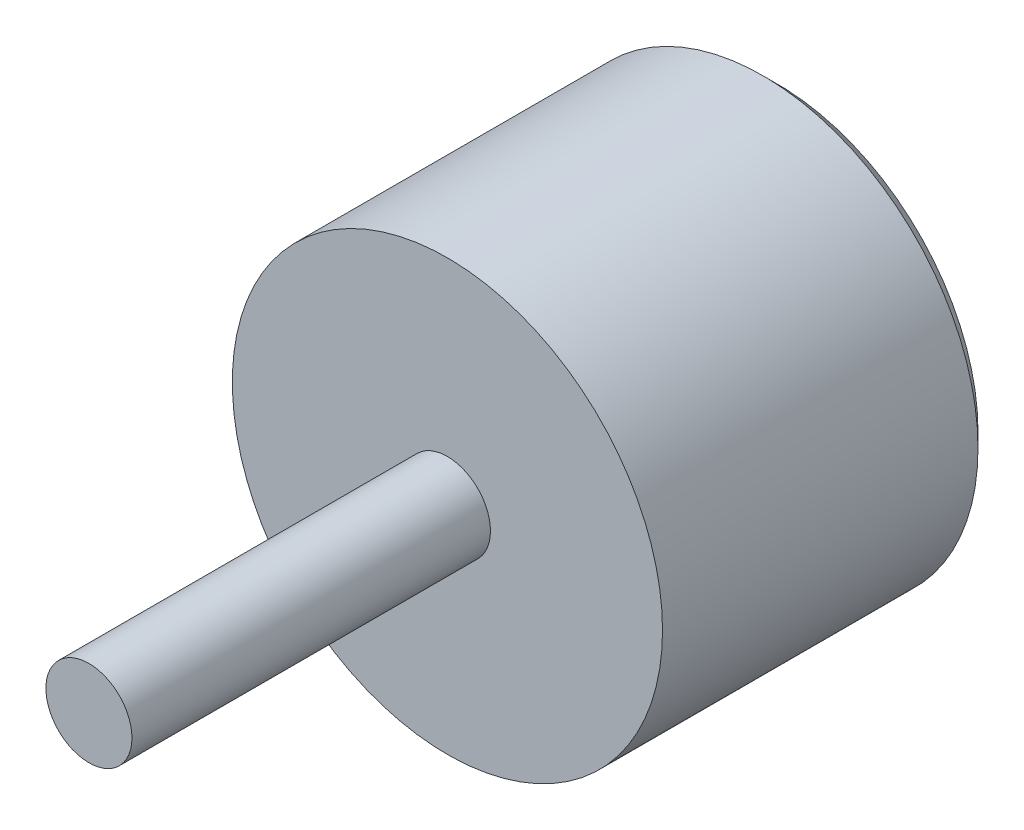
ISO-10303-21;
HEADER;
FILE_DESCRIPTION(('STEP AP214'),'2;1');
FILE_NAME('part.step','',(''),(''),'','','');
FILE_SCHEMA(('AUTOMOTIVE_DESIGN { 1 0 10303 214 1 1 1 1 }'));
ENDSEC;
DATA;
#1=APPLICATION_CONTEXT('core data for automotive mechanical design processes');
#2=APPLICATION_PROTOCOL_DEFINITION('international standard','automotive_design',2000,#1);
#3=PRODUCT_CONTEXT('',#1,'mechanical');
#4=PRODUCT('Part','Part','',(#3));
#5=PRODUCT_RELATED_PRODUCT_CATEGORY('part','',(#4));
#6=PRODUCT_DEFINITION_FORMATION('','',#4);
#7=PRODUCT_DEFINITION_CONTEXT('part definition',#1,'design');
#8=PRODUCT_DEFINITION('design','',#6,#7);
#9=PRODUCT_DEFINITION_SHAPE('','',#8);
#10=(LENGTH_UNIT() NAMED_UNIT(*) SI_UNIT(.MILLI.,.METRE.));
#11=(NAMED_UNIT(*) PLANE_ANGLE_UNIT() SI_UNIT($,.RADIAN.));
#12=(NAMED_UNIT(*) SI_UNIT($,.STERADIAN.) SOLID_ANGLE_UNIT());
#13=UNCERTAINTY_MEASURE_WITH_UNIT(LENGTH_MEASURE(1.E-05),#10,'distance_accuracy_value','');
#14=(GEOMETRIC_REPRESENTATION_CONTEXT(3) GLOBAL_UNCERTAINTY_ASSIGNED_CONTEXT((#13)) GLOBAL_UNIT_ASSIGNED_CONTEXT((#10,
#11,#12)) REPRESENTATION_CONTEXT('',''));
#15=CARTESIAN_POINT('',(0.,0.,0.));
#16=DIRECTION('',(0.,0.,1.));
#17=DIRECTION('',(1.,0.,0.));
#18=AXIS2_PLACEMENT_3D('',#15,#16,#17);
#19=CARTESIAN_POINT('',(0.,0.,46.));
#20=DIRECTION('',(0.,0.,1.));
#21=DIRECTION('',(1.,0.,0.));
#22=AXIS2_PLACEMENT_3D('',#19,#20,#21);
#23=PLANE('',#22);
#24=CARTESIAN_POINT('',(0.,0.,46.));
#25=DIRECTION('',(0.,0.,1.));
#26=DIRECTION('',(1.,0.,0.));
#27=AXIS2_PLACEMENT_3D('',#24,#25,#26);
#28=CIRCLE('',#27,30.);
#29=CARTESIAN_POINT('',(30.,0.,46.));
#30=VERTEX_POINT('',#29);
#31=EDGE_CURVE('E45',#30,#30,#28,.T.);
#32=ORIENTED_EDGE('',*,*,#31,.T.);
#33=EDGE_LOOP('',(#32));
#34=FACE_BOUND('',#33,.T.);
#35=CARTESIAN_POINT('',(0.,0.,46.));
#36=DIRECTION('',(0.,0.,1.));
#37=DIRECTION('',(1.,0.,0.));
#38=AXIS2_PLACEMENT_3D('',#35,#36,#37);
#39=CIRCLE('',#38,6.);
#40=CARTESIAN_POINT('',(6.,0.,46.));
#41=VERTEX_POINT('',#40);
#42=EDGE_CURVE('E52',#41,#41,#39,.T.);
#43=ORIENTED_EDGE('',*,*,#42,.F.);
#44=EDGE_LOOP('',(#43));
#45=FACE_BOUND('',#44,.T.);
#46=ADVANCED_FACE('F31',(#34,#45),#23,.T.);
#47=CARTESIAN_POINT('',(0.,0.,46.));
#48=DIRECTION('',(0.,0.,-1.));
#49=DIRECTION('',(-1.,0.,0.));
#50=AXIS2_PLACEMENT_3D('',#47,#48,#49);
#51=CYLINDRICAL_SURFACE('',#50,30.);
#52=CARTESIAN_POINT('',(0.,0.,2.00000000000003));
#53=DIRECTION('',(0.,0.,1.));
#54=DIRECTION('',(1.,0.,0.));
#55=AXIS2_PLACEMENT_3D('',#52,#53,#54);
#56=CIRCLE('',#55,30.);
#57=CARTESIAN_POINT('',(30.,0.,2.00000000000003));
#58=VERTEX_POINT('',#57);
#59=EDGE_CURVE('E39',#58,#58,#56,.T.);
#60=ORIENTED_EDGE('',*,*,#59,.T.);
#61=EDGE_LOOP('',(#60));
#62=FACE_BOUND('',#61,.T.);
#63=ORIENTED_EDGE('',*,*,#31,.F.);
#64=EDGE_LOOP('',(#63));
#65=FACE_BOUND('',#64,.T.);
#66=ADVANCED_FACE('F76',(#62,#65),#51,.T.);
#67=CARTESIAN_POINT('',(0.,0.,0.));
#68=DIRECTION('',(0.,0.,1.));
#69=DIRECTION('',(1.,0.,0.));
#70=AXIS2_PLACEMENT_3D('',#67,#68,#69);
#71=PLANE('',#70);
#72=CARTESIAN_POINT('',(0.,0.,0.));
#73=DIRECTION('',(0.,0.,1.));
#74=DIRECTION('',(1.,0.,0.));
#75=AXIS2_PLACEMENT_3D('',#72,#73,#74);
#76=CIRCLE('',#75,28.);
#77=CARTESIAN_POINT('',(28.,0.,0.));
#78=VERTEX_POINT('',#77);
#79=EDGE_CURVE('E10',#78,#78,#76,.F.);
#80=ORIENTED_EDGE('',*,*,#79,.T.);
#81=EDGE_LOOP('',(#80));
#82=FACE_BOUND('',#81,.T.);
#83=CARTESIAN_POINT('',(0.,0.,0.));
#84=DIRECTION('',(0.,0.,-1.));
#85=DIRECTION('',(-1.,0.,0.));
#86=AXIS2_PLACEMENT_3D('',#83,#84,#85);
#87=CIRCLE('',#86,17.5);
#88=CARTESIAN_POINT('',(-17.5,0.,0.));
#89=VERTEX_POINT('',#88);
#90=EDGE_CURVE('E58',#89,#89,#87,.T.);
#91=ORIENTED_EDGE('',*,*,#90,.F.);
#92=EDGE_LOOP('',(#91));
#93=FACE_BOUND('',#92,.T.);
#94=ADVANCED_FACE('F73',(#82,#93),#71,.F.);
#95=CARTESIAN_POINT('',(0.,0.,96.));
#96=DIRECTION('',(0.,0.,-1.));
#97=DIRECTION('',(-1.,0.,0.));
#98=AXIS2_PLACEMENT_3D('',#95,#96,#97);
#99=CYLINDRICAL_SURFACE('',#98,6.);
#100=CARTESIAN_POINT('',(0.,0.,96.));
#101=DIRECTION('',(0.,0.,1.));
#102=DIRECTION('',(1.,0.,0.));
#103=AXIS2_PLACEMENT_3D('',#100,#101,#102);
#104=CIRCLE('',#103,6.);
#105=CARTESIAN_POINT('',(6.,0.,96.));
#106=VERTEX_POINT('',#105);
#107=EDGE_CURVE('E49',#106,#106,#104,.T.);
#108=ORIENTED_EDGE('',*,*,#107,.F.);
#109=EDGE_LOOP('',(#108));
#110=FACE_BOUND('',#109,.T.);
#111=ORIENTED_EDGE('',*,*,#42,.T.);
#112=EDGE_LOOP('',(#111));
#113=FACE_BOUND('',#112,.T.);
#114=ADVANCED_FACE('F75',(#110,#113),#99,.T.);
#115=CARTESIAN_POINT('',(0.,0.,96.));
#116=DIRECTION('',(0.,0.,1.));
#117=DIRECTION('',(1.,0.,0.));
#118=AXIS2_PLACEMENT_3D('',#115,#116,#117);
#119=PLANE('',#118);
#120=ORIENTED_EDGE('',*,*,#107,.T.);
#121=EDGE_LOOP('',(#120));
#122=FACE_BOUND('',#121,.T.);
#123=ADVANCED_FACE('F69',(#122),#119,.T.);
#124=CARTESIAN_POINT('',(0.,0.,30.));
#125=DIRECTION('',(0.,0.,-1.));
#126=DIRECTION('',(-1.,0.,0.));
#127=AXIS2_PLACEMENT_3D('',#124,#125,#126);
#128=CYLINDRICAL_SURFACE('',#127,17.5);
#129=CARTESIAN_POINT('',(0.,0.,30.));
#130=DIRECTION('',(0.,0.,-1.));
#131=DIRECTION('',(-1.,0.,0.));
#132=AXIS2_PLACEMENT_3D('',#129,#130,#131);
#133=CIRCLE('',#132,17.5);
#134=CARTESIAN_POINT('',(-17.5,0.,30.));
#135=VERTEX_POINT('',#134);
#136=EDGE_CURVE('E55',#135,#135,#133,.T.);
#137=ORIENTED_EDGE('',*,*,#136,.F.);
#138=EDGE_LOOP('',(#137));
#139=FACE_BOUND('',#138,.T.);
#140=ORIENTED_EDGE('',*,*,#90,.T.);
#141=EDGE_LOOP('',(#140));
#142=FACE_BOUND('',#141,.T.);
#143=ADVANCED_FACE('F66',(#139,#142),#128,.F.);
#144=CARTESIAN_POINT('',(0.,0.,30.));
#145=DIRECTION('',(0.,0.,-1.));
#146=DIRECTION('',(-1.,0.,0.));
#147=AXIS2_PLACEMENT_3D('',#144,#145,#146);
#148=PLANE('',#147);
#149=ORIENTED_EDGE('',*,*,#136,.T.);
#150=EDGE_LOOP('',(#149));
#151=FACE_BOUND('',#150,.T.);
#152=ADVANCED_FACE('F64',(#151),#148,.T.);
#153=CARTESIAN_POINT('',(0.,0.,2.00000000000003));
#154=DIRECTION('',(0.,0.,1.));
#155=DIRECTION('',(1.,0.,0.));
#156=AXIS2_PLACEMENT_3D('',#153,#154,#155);
#157=CONICAL_SURFACE('',#156,30.,0.785398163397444);
#158=ORIENTED_EDGE('',*,*,#79,.F.);
#159=EDGE_LOOP('',(#158));
#160=FACE_BOUND('',#159,.T.);
#161=ORIENTED_EDGE('',*,*,#59,.F.);
#162=EDGE_LOOP('',(#161));
#163=FACE_BOUND('',#162,.T.);
#164=ADVANCED_FACE('F33',(#160,#163),#157,.T.);
#165=CLOSED_SHELL('',(#46,#66,#94,#114,#123,#143,#152,#164));
#166=MANIFOLD_SOLID_BREP('B2',#165);
#167=ADVANCED_BREP_SHAPE_REPRESENTATION('',(#18,#166),#14);
#168=SHAPE_DEFINITION_REPRESENTATION(#9,#167);
ENDSEC;
END-ISO-10303-21;
